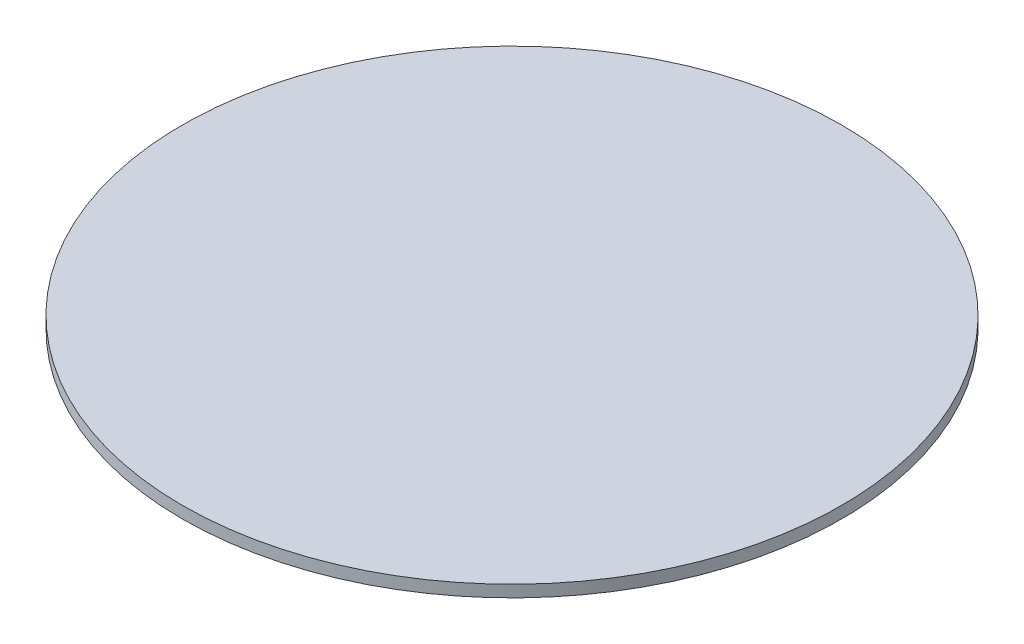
ISO-10303-21;
HEADER;
FILE_DESCRIPTION(('STEP AP214'),'2;1');
FILE_NAME('part.step','',(''),(''),'','','');
FILE_SCHEMA(('AUTOMOTIVE_DESIGN { 1 0 10303 214 1 1 1 1 }'));
ENDSEC;
DATA;
#1=APPLICATION_CONTEXT('core data for automotive mechanical design processes');
#2=APPLICATION_PROTOCOL_DEFINITION('international standard','automotive_design',2000,#1);
#3=PRODUCT_CONTEXT('',#1,'mechanical');
#4=PRODUCT('Part','Part','',(#3));
#5=PRODUCT_RELATED_PRODUCT_CATEGORY('part','',(#4));
#6=PRODUCT_DEFINITION_FORMATION('','',#4);
#7=PRODUCT_DEFINITION_CONTEXT('part definition',#1,'design');
#8=PRODUCT_DEFINITION('design','',#6,#7);
#9=PRODUCT_DEFINITION_SHAPE('','',#8);
#10=(LENGTH_UNIT() NAMED_UNIT(*) SI_UNIT(.MILLI.,.METRE.));
#11=(NAMED_UNIT(*) PLANE_ANGLE_UNIT() SI_UNIT($,.RADIAN.));
#12=(NAMED_UNIT(*) SI_UNIT($,.STERADIAN.) SOLID_ANGLE_UNIT());
#13=UNCERTAINTY_MEASURE_WITH_UNIT(LENGTH_MEASURE(1.E-05),#10,'distance_accuracy_value','');
#14=(GEOMETRIC_REPRESENTATION_CONTEXT(3) GLOBAL_UNCERTAINTY_ASSIGNED_CONTEXT((#13)) GLOBAL_UNIT_ASSIGNED_CONTEXT((#10,
#11,#12)) REPRESENTATION_CONTEXT('',''));
#15=CARTESIAN_POINT('',(0.,0.,0.));
#16=DIRECTION('',(0.,0.,1.));
#17=DIRECTION('',(1.,0.,0.));
#18=AXIS2_PLACEMENT_3D('',#15,#16,#17);
#19=CARTESIAN_POINT('',(0.,6.35,0.));
#20=DIRECTION('',(0.,-1.,0.));
#21=DIRECTION('',(0.,0.,-1.));
#22=AXIS2_PLACEMENT_3D('',#19,#20,#21);
#23=CYLINDRICAL_SURFACE('',#22,177.);
#24=CARTESIAN_POINT('',(0.,6.35,0.));
#25=DIRECTION('',(0.,1.,0.));
#26=DIRECTION('',(0.,0.,1.));
#27=AXIS2_PLACEMENT_3D('',#24,#25,#26);
#28=CIRCLE('',#27,177.);
#29=CARTESIAN_POINT('',(0.,6.35,177.));
#30=VERTEX_POINT('',#29);
#31=EDGE_CURVE('E10',#30,#30,#28,.T.);
#32=ORIENTED_EDGE('',*,*,#31,.F.);
#33=EDGE_LOOP('',(#32));
#34=FACE_BOUND('',#33,.T.);
#35=CARTESIAN_POINT('',(0.,0.,0.));
#36=DIRECTION('',(0.,1.,0.));
#37=DIRECTION('',(0.,0.,1.));
#38=AXIS2_PLACEMENT_3D('',#35,#36,#37);
#39=CIRCLE('',#38,177.);
#40=CARTESIAN_POINT('',(0.,0.,177.));
#41=VERTEX_POINT('',#40);
#42=EDGE_CURVE('E38',#41,#41,#39,.T.);
#43=ORIENTED_EDGE('',*,*,#42,.T.);
#44=EDGE_LOOP('',(#43));
#45=FACE_BOUND('',#44,.T.);
#46=ADVANCED_FACE('F35',(#34,#45),#23,.T.);
#47=CARTESIAN_POINT('',(0.,6.35,0.));
#48=DIRECTION('',(0.,1.,0.));
#49=DIRECTION('',(0.,0.,1.));
#50=AXIS2_PLACEMENT_3D('',#47,#48,#49);
#51=PLANE('',#50);
#52=ORIENTED_EDGE('',*,*,#31,.T.);
#53=EDGE_LOOP('',(#52));
#54=FACE_BOUND('',#53,.T.);
#55=ADVANCED_FACE('F50',(#54),#51,.T.);
#56=CARTESIAN_POINT('',(0.,0.,0.));
#57=DIRECTION('',(0.,1.,0.));
#58=DIRECTION('',(0.,0.,1.));
#59=AXIS2_PLACEMENT_3D('',#56,#57,#58);
#60=PLANE('',#59);
#61=ORIENTED_EDGE('',*,*,#42,.F.);
#62=EDGE_LOOP('',(#61));
#63=FACE_BOUND('',#62,.T.);
#64=ADVANCED_FACE('F48',(#63),#60,.F.);
#65=CLOSED_SHELL('',(#46,#55,#64));
#66=MANIFOLD_SOLID_BREP('B2',#65);
#67=ADVANCED_BREP_SHAPE_REPRESENTATION('',(#18,#66),#14);
#68=SHAPE_DEFINITION_REPRESENTATION(#9,#67);
ENDSEC;
END-ISO-10303-21;
